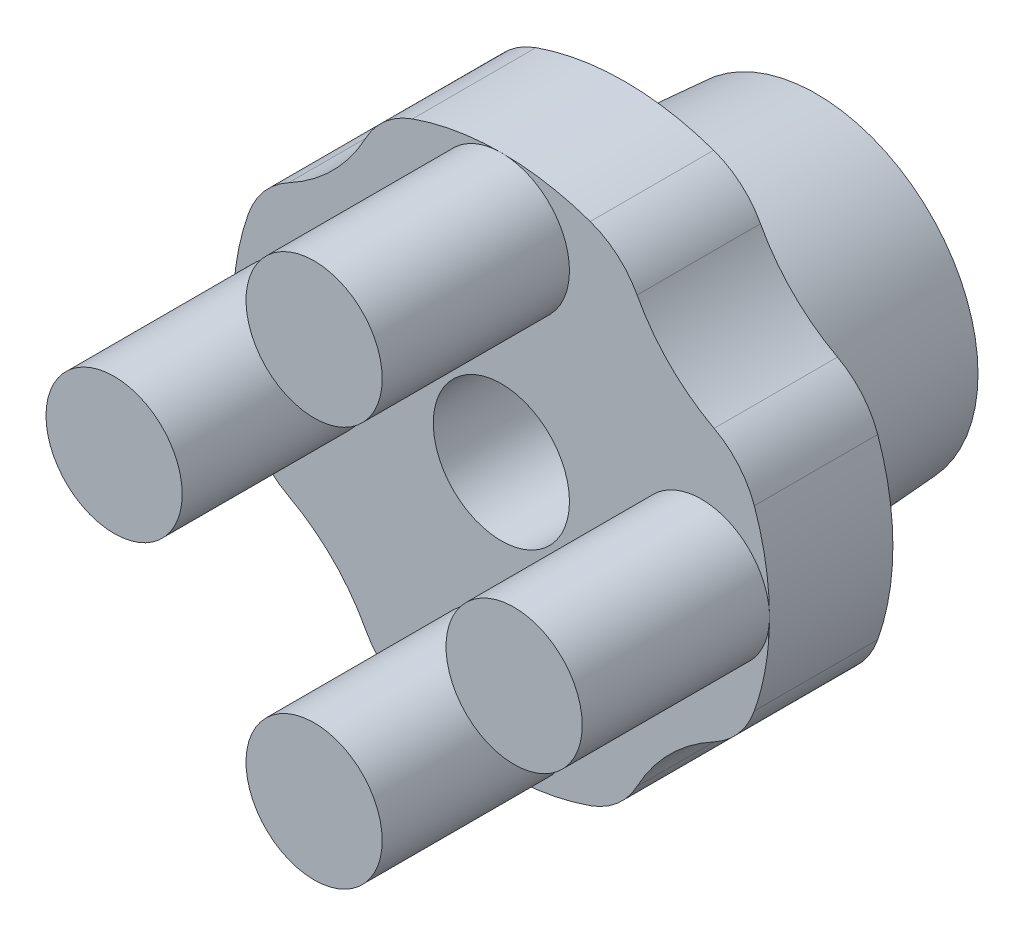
ISO-10303-21;
HEADER;
FILE_DESCRIPTION(('STEP AP214'),'2;1');
FILE_NAME('part.step','',(''),(''),'','','');
FILE_SCHEMA(('AUTOMOTIVE_DESIGN { 1 0 10303 214 1 1 1 1 }'));
ENDSEC;
DATA;
#1=APPLICATION_CONTEXT('core data for automotive mechanical design processes');
#2=APPLICATION_PROTOCOL_DEFINITION('international standard','automotive_design',2000,#1);
#3=PRODUCT_CONTEXT('',#1,'mechanical');
#4=PRODUCT('Part','Part','',(#3));
#5=PRODUCT_RELATED_PRODUCT_CATEGORY('part','',(#4));
#6=PRODUCT_DEFINITION_FORMATION('','',#4);
#7=PRODUCT_DEFINITION_CONTEXT('part definition',#1,'design');
#8=PRODUCT_DEFINITION('design','',#6,#7);
#9=PRODUCT_DEFINITION_SHAPE('','',#8);
#10=(LENGTH_UNIT() NAMED_UNIT(*) SI_UNIT(.MILLI.,.METRE.));
#11=(NAMED_UNIT(*) PLANE_ANGLE_UNIT() SI_UNIT($,.RADIAN.));
#12=(NAMED_UNIT(*) SI_UNIT($,.STERADIAN.) SOLID_ANGLE_UNIT());
#13=UNCERTAINTY_MEASURE_WITH_UNIT(LENGTH_MEASURE(1.E-05),#10,'distance_accuracy_value','');
#14=(GEOMETRIC_REPRESENTATION_CONTEXT(3) GLOBAL_UNCERTAINTY_ASSIGNED_CONTEXT((#13)) GLOBAL_UNIT_ASSIGNED_CONTEXT((#10,
#11,#12)) REPRESENTATION_CONTEXT('',''));
#15=CARTESIAN_POINT('',(0.,0.,0.));
#16=DIRECTION('',(0.,0.,1.));
#17=DIRECTION('',(1.,0.,0.));
#18=AXIS2_PLACEMENT_3D('',#15,#16,#17);
#19=CARTESIAN_POINT('',(0.,0.,90.));
#20=DIRECTION('',(0.,0.,1.));
#21=DIRECTION('',(1.,0.,0.));
#22=AXIS2_PLACEMENT_3D('',#19,#20,#21);
#23=CYLINDRICAL_SURFACE('',#22,31.5);
#24=CARTESIAN_POINT('',(0.,0.,22.5));
#25=DIRECTION('',(0.,0.,1.));
#26=DIRECTION('',(1.,0.,0.));
#27=AXIS2_PLACEMENT_3D('',#24,#25,#26);
#28=CIRCLE('',#27,31.5);
#29=CARTESIAN_POINT('',(-29.7192701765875,10.44102390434,22.5));
#30=VERTEX_POINT('',#29);
#31=CARTESIAN_POINT('',(-29.7192701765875,-10.44102390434,22.5));
#32=VERTEX_POINT('',#31);
#33=EDGE_CURVE('E171',#30,#32,#28,.T.);
#34=ORIENTED_EDGE('',*,*,#33,.T.);
#35=DIRECTION('',(0.,0.,1.));
#36=VECTOR('',#35,1.);
#37=CARTESIAN_POINT('',(-29.7192701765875,-10.44102390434,90.));
#38=LINE('',#37,#36);
#39=CARTESIAN_POINT('',(-29.7192701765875,-10.44102390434,37.));
#40=VERTEX_POINT('',#39);
#41=EDGE_CURVE('E225',#32,#40,#38,.T.);
#42=ORIENTED_EDGE('',*,*,#41,.T.);
#43=CARTESIAN_POINT('',(0.,0.,37.));
#44=DIRECTION('',(0.,0.,1.));
#45=DIRECTION('',(1.,0.,0.));
#46=AXIS2_PLACEMENT_3D('',#43,#44,#45);
#47=CIRCLE('',#46,31.5);
#48=CARTESIAN_POINT('',(-31.5,0.,37.));
#49=VERTEX_POINT('',#48);
#50=EDGE_CURVE('E161',#49,#40,#47,.T.);
#51=ORIENTED_EDGE('',*,*,#50,.F.);
#52=CARTESIAN_POINT('',(-29.7192701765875,10.44102390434,37.));
#53=VERTEX_POINT('',#52);
#54=EDGE_CURVE('E157',#53,#49,#47,.T.);
#55=ORIENTED_EDGE('',*,*,#54,.F.);
#56=DIRECTION('',(0.,0.,1.));
#57=VECTOR('',#56,1.);
#58=CARTESIAN_POINT('',(-29.7192701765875,10.44102390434,90.));
#59=LINE('',#58,#57);
#60=EDGE_CURVE('E223',#53,#30,#59,.F.);
#61=ORIENTED_EDGE('',*,*,#60,.T.);
#62=EDGE_LOOP('',(#34,#42,#51,#55,#61));
#63=FACE_BOUND('',#62,.T.);
#64=ADVANCED_FACE('F14',(#63),#23,.T.);
#65=CARTESIAN_POINT('',(-31.5,0.,37.));
#66=DIRECTION('',(0.,0.,-1.));
#67=DIRECTION('',(-1.,0.,0.));
#68=AXIS2_PLACEMENT_3D('',#65,#66,#67);
#69=PLANE('',#68);
#70=CARTESIAN_POINT('',(0.,0.,37.));
#71=DIRECTION('',(0.,0.,1.));
#72=DIRECTION('',(1.,0.,0.));
#73=AXIS2_PLACEMENT_3D('',#70,#71,#72);
#74=CIRCLE('',#73,8.);
#75=CARTESIAN_POINT('',(8.,0.,37.));
#76=VERTEX_POINT('',#75);
#77=EDGE_CURVE('E319',#76,#76,#74,.T.);
#78=ORIENTED_EDGE('',*,*,#77,.F.);
#79=EDGE_LOOP('',(#78));
#80=FACE_BOUND('',#79,.T.);
#81=CARTESIAN_POINT('',(0.,-31.5,37.));
#82=VERTEX_POINT('',#81);
#83=CARTESIAN_POINT('',(10.44102390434,-29.7192701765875,37.));
#84=VERTEX_POINT('',#83);
#85=EDGE_CURVE('E147',#82,#84,#47,.T.);
#86=ORIENTED_EDGE('',*,*,#85,.T.);
#87=CARTESIAN_POINT('',(7.12641314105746,-20.2845812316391,37.));
#88=DIRECTION('',(0.,0.,-1.));
#89=DIRECTION('',(-1.,0.,0.));
#90=AXIS2_PLACEMENT_3D('',#87,#88,#89);
#91=CIRCLE('',#90,10.);
#92=CARTESIAN_POINT('',(15.9479524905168,-24.9941930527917,37.));
#93=VERTEX_POINT('',#92);
#94=EDGE_CURVE('E246',#84,#93,#91,.F.);
#95=ORIENTED_EDGE('',*,*,#94,.T.);
#96=CARTESIAN_POINT('',(35.3553390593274,-35.3553390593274,37.));
#97=DIRECTION('',(0.,0.,1.));
#98=DIRECTION('',(1.,0.,0.));
#99=AXIS2_PLACEMENT_3D('',#96,#97,#98);
#100=CIRCLE('',#99,22.);
#101=CARTESIAN_POINT('',(24.9941930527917,-15.9479524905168,37.));
#102=VERTEX_POINT('',#101);
#103=EDGE_CURVE('E285',#102,#93,#100,.T.);
#104=ORIENTED_EDGE('',*,*,#103,.F.);
#105=CARTESIAN_POINT('',(20.2845812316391,-7.12641314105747,37.));
#106=DIRECTION('',(0.,0.,-1.));
#107=DIRECTION('',(-1.,0.,0.));
#108=AXIS2_PLACEMENT_3D('',#105,#106,#107);
#109=CIRCLE('',#108,10.);
#110=CARTESIAN_POINT('',(29.7192701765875,-10.44102390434,37.));
#111=VERTEX_POINT('',#110);
#112=EDGE_CURVE('E146',#102,#111,#109,.F.);
#113=ORIENTED_EDGE('',*,*,#112,.T.);
#114=CARTESIAN_POINT('',(31.5,0.,37.));
#115=VERTEX_POINT('',#114);
#116=EDGE_CURVE('E139',#111,#115,#47,.T.);
#117=ORIENTED_EDGE('',*,*,#116,.T.);
#118=CARTESIAN_POINT('',(23.5,0.,37.));
#119=DIRECTION('',(0.,0.,1.));
#120=DIRECTION('',(1.,0.,0.));
#121=AXIS2_PLACEMENT_3D('',#118,#119,#120);
#122=CIRCLE('',#121,8.);
#123=EDGE_CURVE('E144',#115,#115,#122,.T.);
#124=ORIENTED_EDGE('',*,*,#123,.F.);
#125=CARTESIAN_POINT('',(29.7192701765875,10.44102390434,37.));
#126=VERTEX_POINT('',#125);
#127=EDGE_CURVE('E148',#115,#126,#47,.T.);
#128=ORIENTED_EDGE('',*,*,#127,.T.);
#129=CARTESIAN_POINT('',(20.2845812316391,7.12641314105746,37.));
#130=DIRECTION('',(0.,0.,-1.));
#131=DIRECTION('',(-1.,0.,0.));
#132=AXIS2_PLACEMENT_3D('',#129,#130,#131);
#133=CIRCLE('',#132,10.);
#134=CARTESIAN_POINT('',(24.9941930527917,15.9479524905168,37.));
#135=VERTEX_POINT('',#134);
#136=EDGE_CURVE('E207',#126,#135,#133,.F.);
#137=ORIENTED_EDGE('',*,*,#136,.T.);
#138=CARTESIAN_POINT('',(35.3553390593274,35.3553390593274,37.));
#139=DIRECTION('',(0.,0.,-1.));
#140=DIRECTION('',(-1.,0.,0.));
#141=AXIS2_PLACEMENT_3D('',#138,#139,#140);
#142=CIRCLE('',#141,22.);
#143=CARTESIAN_POINT('',(15.9479524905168,24.9941930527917,37.));
#144=VERTEX_POINT('',#143);
#145=EDGE_CURVE('E290',#135,#144,#142,.T.);
#146=ORIENTED_EDGE('',*,*,#145,.T.);
#147=CARTESIAN_POINT('',(7.12641314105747,20.2845812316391,37.));
#148=DIRECTION('',(0.,0.,-1.));
#149=DIRECTION('',(-1.,0.,0.));
#150=AXIS2_PLACEMENT_3D('',#147,#148,#149);
#151=CIRCLE('',#150,10.);
#152=CARTESIAN_POINT('',(10.44102390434,29.7192701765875,37.));
#153=VERTEX_POINT('',#152);
#154=EDGE_CURVE('E203',#144,#153,#151,.F.);
#155=ORIENTED_EDGE('',*,*,#154,.T.);
#156=CARTESIAN_POINT('',(0.,31.5,37.));
#157=VERTEX_POINT('',#156);
#158=EDGE_CURVE('E155',#153,#157,#47,.T.);
#159=ORIENTED_EDGE('',*,*,#158,.T.);
#160=CARTESIAN_POINT('',(0.,23.5,37.));
#161=DIRECTION('',(0.,0.,1.));
#162=DIRECTION('',(1.,0.,0.));
#163=AXIS2_PLACEMENT_3D('',#160,#161,#162);
#164=CIRCLE('',#163,8.);
#165=EDGE_CURVE('E277',#157,#157,#164,.T.);
#166=ORIENTED_EDGE('',*,*,#165,.F.);
#167=CARTESIAN_POINT('',(-10.44102390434,29.7192701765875,37.));
#168=VERTEX_POINT('',#167);
#169=EDGE_CURVE('E156',#157,#168,#47,.T.);
#170=ORIENTED_EDGE('',*,*,#169,.T.);
#171=CARTESIAN_POINT('',(-7.12641314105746,20.2845812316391,37.));
#172=DIRECTION('',(0.,0.,-1.));
#173=DIRECTION('',(-1.,0.,0.));
#174=AXIS2_PLACEMENT_3D('',#171,#172,#173);
#175=CIRCLE('',#174,10.);
#176=CARTESIAN_POINT('',(-15.9479524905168,24.9941930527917,37.));
#177=VERTEX_POINT('',#176);
#178=EDGE_CURVE('E202',#168,#177,#175,.F.);
#179=ORIENTED_EDGE('',*,*,#178,.T.);
#180=CARTESIAN_POINT('',(-35.3553390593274,35.3553390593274,37.));
#181=DIRECTION('',(0.,0.,1.));
#182=DIRECTION('',(1.,0.,0.));
#183=AXIS2_PLACEMENT_3D('',#180,#181,#182);
#184=CIRCLE('',#183,22.);
#185=CARTESIAN_POINT('',(-24.9941930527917,15.9479524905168,37.));
#186=VERTEX_POINT('',#185);
#187=EDGE_CURVE('E302',#186,#177,#184,.T.);
#188=ORIENTED_EDGE('',*,*,#187,.F.);
#189=CARTESIAN_POINT('',(-20.2845812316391,7.12641314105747,37.));
#190=DIRECTION('',(0.,0.,-1.));
#191=DIRECTION('',(-1.,0.,0.));
#192=AXIS2_PLACEMENT_3D('',#189,#190,#191);
#193=CIRCLE('',#192,10.);
#194=EDGE_CURVE('E309',#186,#53,#193,.F.);
#195=ORIENTED_EDGE('',*,*,#194,.T.);
#196=ORIENTED_EDGE('',*,*,#54,.T.);
#197=CARTESIAN_POINT('',(-23.5,0.,37.));
#198=DIRECTION('',(0.,0.,1.));
#199=DIRECTION('',(1.,0.,0.));
#200=AXIS2_PLACEMENT_3D('',#197,#198,#199);
#201=CIRCLE('',#200,8.);
#202=EDGE_CURVE('E269',#49,#49,#201,.T.);
#203=ORIENTED_EDGE('',*,*,#202,.F.);
#204=ORIENTED_EDGE('',*,*,#50,.T.);
#205=CARTESIAN_POINT('',(-20.2845812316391,-7.12641314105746,37.));
#206=DIRECTION('',(0.,0.,-1.));
#207=DIRECTION('',(-1.,0.,0.));
#208=AXIS2_PLACEMENT_3D('',#205,#206,#207);
#209=CIRCLE('',#208,10.);
#210=CARTESIAN_POINT('',(-24.9941930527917,-15.9479524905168,37.));
#211=VERTEX_POINT('',#210);
#212=EDGE_CURVE('E230',#40,#211,#209,.F.);
#213=ORIENTED_EDGE('',*,*,#212,.T.);
#214=CARTESIAN_POINT('',(-35.3553390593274,-35.3553390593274,37.));
#215=DIRECTION('',(0.,0.,-1.));
#216=DIRECTION('',(-1.,0.,0.));
#217=AXIS2_PLACEMENT_3D('',#214,#215,#216);
#218=CIRCLE('',#217,22.);
#219=CARTESIAN_POINT('',(-15.9479524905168,-24.9941930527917,37.));
#220=VERTEX_POINT('',#219);
#221=EDGE_CURVE('E296',#211,#220,#218,.T.);
#222=ORIENTED_EDGE('',*,*,#221,.T.);
#223=CARTESIAN_POINT('',(-7.12641314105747,-20.2845812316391,37.));
#224=DIRECTION('',(0.,0.,-1.));
#225=DIRECTION('',(-1.,0.,0.));
#226=AXIS2_PLACEMENT_3D('',#223,#224,#225);
#227=CIRCLE('',#226,10.);
#228=CARTESIAN_POINT('',(-10.44102390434,-29.7192701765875,37.));
#229=VERTEX_POINT('',#228);
#230=EDGE_CURVE('E228',#220,#229,#227,.F.);
#231=ORIENTED_EDGE('',*,*,#230,.T.);
#232=EDGE_CURVE('E150',#229,#82,#47,.T.);
#233=ORIENTED_EDGE('',*,*,#232,.T.);
#234=CARTESIAN_POINT('',(0.,-23.5,37.));
#235=DIRECTION('',(0.,0.,1.));
#236=DIRECTION('',(1.,0.,0.));
#237=AXIS2_PLACEMENT_3D('',#234,#235,#236);
#238=CIRCLE('',#237,8.);
#239=EDGE_CURVE('E263',#82,#82,#238,.T.);
#240=ORIENTED_EDGE('',*,*,#239,.F.);
#241=EDGE_LOOP('',(#86,#95,#104,#113,#117,#124,#128,#137,#146,#155,#159,#166,#170,#179,#188,
#195,#196,#203,#204,#213,#222,#231,#233,#240));
#242=FACE_BOUND('',#241,.T.);
#243=ADVANCED_FACE('F16',(#80,#242),#69,.F.);
#244=CARTESIAN_POINT('',(-20.5,0.,22.5));
#245=DIRECTION('',(0.,0.,1.));
#246=DIRECTION('',(1.,0.,0.));
#247=AXIS2_PLACEMENT_3D('',#244,#245,#246);
#248=PLANE('',#247);
#249=CARTESIAN_POINT('',(0.,0.,22.5));
#250=DIRECTION('',(0.,0.,1.));
#251=DIRECTION('',(1.,0.,0.));
#252=AXIS2_PLACEMENT_3D('',#249,#250,#251);
#253=CIRCLE('',#252,20.5);
#254=CARTESIAN_POINT('',(20.5,0.,22.5));
#255=VERTEX_POINT('',#254);
#256=EDGE_CURVE('E180',#255,#255,#253,.T.);
#257=ORIENTED_EDGE('',*,*,#256,.T.);
#258=EDGE_LOOP('',(#257));
#259=FACE_BOUND('',#258,.T.);
#260=CARTESIAN_POINT('',(35.3553390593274,-35.3553390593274,22.5));
#261=DIRECTION('',(0.,0.,1.));
#262=DIRECTION('',(1.,0.,0.));
#263=AXIS2_PLACEMENT_3D('',#260,#261,#262);
#264=CIRCLE('',#263,22.);
#265=CARTESIAN_POINT('',(24.9941930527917,-15.9479524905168,22.5));
#266=VERTEX_POINT('',#265);
#267=CARTESIAN_POINT('',(15.9479524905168,-24.9941930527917,22.5));
#268=VERTEX_POINT('',#267);
#269=EDGE_CURVE('E256',#266,#268,#264,.T.);
#270=ORIENTED_EDGE('',*,*,#269,.T.);
#271=CARTESIAN_POINT('',(7.12641314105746,-20.2845812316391,22.5));
#272=DIRECTION('',(0.,0.,1.));
#273=DIRECTION('',(1.,0.,0.));
#274=AXIS2_PLACEMENT_3D('',#271,#272,#273);
#275=CIRCLE('',#274,10.);
#276=CARTESIAN_POINT('',(10.44102390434,-29.7192701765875,22.5));
#277=VERTEX_POINT('',#276);
#278=EDGE_CURVE('E22',#268,#277,#275,.F.);
#279=ORIENTED_EDGE('',*,*,#278,.T.);
#280=CARTESIAN_POINT('',(-10.44102390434,-29.7192701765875,22.5));
#281=VERTEX_POINT('',#280);
#282=EDGE_CURVE('E167',#281,#277,#28,.T.);
#283=ORIENTED_EDGE('',*,*,#282,.F.);
#284=CARTESIAN_POINT('',(-7.12641314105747,-20.2845812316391,22.5));
#285=DIRECTION('',(0.,0.,1.));
#286=DIRECTION('',(1.,0.,0.));
#287=AXIS2_PLACEMENT_3D('',#284,#285,#286);
#288=CIRCLE('',#287,10.);
#289=CARTESIAN_POINT('',(-15.9479524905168,-24.9941930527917,22.5));
#290=VERTEX_POINT('',#289);
#291=EDGE_CURVE('E237',#281,#290,#288,.F.);
#292=ORIENTED_EDGE('',*,*,#291,.T.);
#293=CARTESIAN_POINT('',(-35.3553390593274,-35.3553390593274,22.5));
#294=DIRECTION('',(0.,0.,1.));
#295=DIRECTION('',(1.,0.,0.));
#296=AXIS2_PLACEMENT_3D('',#293,#294,#295);
#297=CIRCLE('',#296,22.);
#298=CARTESIAN_POINT('',(-24.9941930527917,-15.9479524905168,22.5));
#299=VERTEX_POINT('',#298);
#300=EDGE_CURVE('E293',#299,#290,#297,.F.);
#301=ORIENTED_EDGE('',*,*,#300,.F.);
#302=CARTESIAN_POINT('',(-20.2845812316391,-7.12641314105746,22.5));
#303=DIRECTION('',(0.,0.,1.));
#304=DIRECTION('',(1.,0.,0.));
#305=AXIS2_PLACEMENT_3D('',#302,#303,#304);
#306=CIRCLE('',#305,10.);
#307=EDGE_CURVE('E239',#299,#32,#306,.F.);
#308=ORIENTED_EDGE('',*,*,#307,.T.);
#309=ORIENTED_EDGE('',*,*,#33,.F.);
#310=CARTESIAN_POINT('',(-20.2845812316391,7.12641314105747,22.5));
#311=DIRECTION('',(0.,0.,1.));
#312=DIRECTION('',(1.,0.,0.));
#313=AXIS2_PLACEMENT_3D('',#310,#311,#312);
#314=CIRCLE('',#313,10.);
#315=CARTESIAN_POINT('',(-24.9941930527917,15.9479524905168,22.5));
#316=VERTEX_POINT('',#315);
#317=EDGE_CURVE('E205',#30,#316,#314,.F.);
#318=ORIENTED_EDGE('',*,*,#317,.T.);
#319=CARTESIAN_POINT('',(-35.3553390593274,35.3553390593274,22.5));
#320=DIRECTION('',(0.,0.,1.));
#321=DIRECTION('',(1.,0.,0.));
#322=AXIS2_PLACEMENT_3D('',#319,#320,#321);
#323=CIRCLE('',#322,22.);
#324=CARTESIAN_POINT('',(-15.9479524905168,24.9941930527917,22.5));
#325=VERTEX_POINT('',#324);
#326=EDGE_CURVE('E299',#316,#325,#323,.T.);
#327=ORIENTED_EDGE('',*,*,#326,.T.);
#328=CARTESIAN_POINT('',(-7.12641314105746,20.2845812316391,22.5));
#329=DIRECTION('',(0.,0.,1.));
#330=DIRECTION('',(1.,0.,0.));
#331=AXIS2_PLACEMENT_3D('',#328,#329,#330);
#332=CIRCLE('',#331,10.);
#333=CARTESIAN_POINT('',(-10.44102390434,29.7192701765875,22.5));
#334=VERTEX_POINT('',#333);
#335=EDGE_CURVE('E201',#325,#334,#332,.F.);
#336=ORIENTED_EDGE('',*,*,#335,.T.);
#337=CARTESIAN_POINT('',(10.44102390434,29.7192701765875,22.5));
#338=VERTEX_POINT('',#337);
#339=EDGE_CURVE('E178',#338,#334,#28,.T.);
#340=ORIENTED_EDGE('',*,*,#339,.F.);
#341=CARTESIAN_POINT('',(7.12641314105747,20.2845812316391,22.5));
#342=DIRECTION('',(0.,0.,1.));
#343=DIRECTION('',(1.,0.,0.));
#344=AXIS2_PLACEMENT_3D('',#341,#342,#343);
#345=CIRCLE('',#344,10.);
#346=CARTESIAN_POINT('',(15.9479524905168,24.9941930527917,22.5));
#347=VERTEX_POINT('',#346);
#348=EDGE_CURVE('E215',#338,#347,#345,.F.);
#349=ORIENTED_EDGE('',*,*,#348,.T.);
#350=CARTESIAN_POINT('',(35.3553390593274,35.3553390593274,22.5));
#351=DIRECTION('',(0.,0.,1.));
#352=DIRECTION('',(1.,0.,0.));
#353=AXIS2_PLACEMENT_3D('',#350,#351,#352);
#354=CIRCLE('',#353,22.);
#355=CARTESIAN_POINT('',(24.9941930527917,15.9479524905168,22.5));
#356=VERTEX_POINT('',#355);
#357=EDGE_CURVE('E287',#356,#347,#354,.F.);
#358=ORIENTED_EDGE('',*,*,#357,.F.);
#359=CARTESIAN_POINT('',(20.2845812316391,7.12641314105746,22.5));
#360=DIRECTION('',(0.,0.,1.));
#361=DIRECTION('',(1.,0.,0.));
#362=AXIS2_PLACEMENT_3D('',#359,#360,#361);
#363=CIRCLE('',#362,10.);
#364=CARTESIAN_POINT('',(29.7192701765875,10.44102390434,22.5));
#365=VERTEX_POINT('',#364);
#366=EDGE_CURVE('E213',#356,#365,#363,.F.);
#367=ORIENTED_EDGE('',*,*,#366,.T.);
#368=CARTESIAN_POINT('',(29.7192701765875,-10.44102390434,22.5));
#369=VERTEX_POINT('',#368);
#370=EDGE_CURVE('E172',#369,#365,#28,.T.);
#371=ORIENTED_EDGE('',*,*,#370,.F.);
#372=CARTESIAN_POINT('',(20.2845812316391,-7.12641314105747,22.5));
#373=DIRECTION('',(0.,0.,1.));
#374=DIRECTION('',(1.,0.,0.));
#375=AXIS2_PLACEMENT_3D('',#372,#373,#374);
#376=CIRCLE('',#375,10.);
#377=EDGE_CURVE('E252',#369,#266,#376,.F.);
#378=ORIENTED_EDGE('',*,*,#377,.T.);
#379=EDGE_LOOP('',(#270,#279,#283,#292,#301,#308,#309,#318,#327,#336,#340,#349,#358,#367,#371,#378));
#380=FACE_BOUND('',#379,.T.);
#381=ADVANCED_FACE('F254',(#259,#380),#248,.F.);
#382=ORIENTED_EDGE('',*,*,#282,.T.);
#383=DIRECTION('',(0.,0.,1.));
#384=VECTOR('',#383,1.);
#385=CARTESIAN_POINT('',(10.44102390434,-29.7192701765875,90.));
#386=LINE('',#385,#384);
#387=EDGE_CURVE('E243',#277,#84,#386,.T.);
#388=ORIENTED_EDGE('',*,*,#387,.T.);
#389=ORIENTED_EDGE('',*,*,#85,.F.);
#390=ORIENTED_EDGE('',*,*,#232,.F.);
#391=DIRECTION('',(0.,0.,1.));
#392=VECTOR('',#391,1.);
#393=CARTESIAN_POINT('',(-10.44102390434,-29.7192701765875,90.));
#394=LINE('',#393,#392);
#395=EDGE_CURVE('E241',#229,#281,#394,.F.);
#396=ORIENTED_EDGE('',*,*,#395,.T.);
#397=EDGE_LOOP('',(#382,#388,#389,#390,#396));
#398=FACE_BOUND('',#397,.T.);
#399=ADVANCED_FACE('F259',(#398),#23,.T.);
#400=ORIENTED_EDGE('',*,*,#158,.F.);
#401=DIRECTION('',(0.,0.,1.));
#402=VECTOR('',#401,1.);
#403=CARTESIAN_POINT('',(10.44102390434,29.7192701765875,90.));
#404=LINE('',#403,#402);
#405=EDGE_CURVE('E194',#153,#338,#404,.F.);
#406=ORIENTED_EDGE('',*,*,#405,.T.);
#407=ORIENTED_EDGE('',*,*,#339,.T.);
#408=DIRECTION('',(0.,0.,1.));
#409=VECTOR('',#408,1.);
#410=CARTESIAN_POINT('',(-10.44102390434,29.7192701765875,90.));
#411=LINE('',#410,#409);
#412=EDGE_CURVE('E192',#334,#168,#411,.T.);
#413=ORIENTED_EDGE('',*,*,#412,.T.);
#414=ORIENTED_EDGE('',*,*,#169,.F.);
#415=EDGE_LOOP('',(#400,#406,#407,#413,#414));
#416=FACE_BOUND('',#415,.T.);
#417=ADVANCED_FACE('F190',(#416),#23,.T.);
#418=ORIENTED_EDGE('',*,*,#116,.F.);
#419=DIRECTION('',(0.,0.,1.));
#420=VECTOR('',#419,1.);
#421=CARTESIAN_POINT('',(29.7192701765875,-10.44102390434,90.));
#422=LINE('',#421,#420);
#423=EDGE_CURVE('E9',#111,#369,#422,.F.);
#424=ORIENTED_EDGE('',*,*,#423,.T.);
#425=ORIENTED_EDGE('',*,*,#370,.T.);
#426=DIRECTION('',(0.,0.,1.));
#427=VECTOR('',#426,1.);
#428=CARTESIAN_POINT('',(29.7192701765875,10.44102390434,90.));
#429=LINE('',#428,#427);
#430=EDGE_CURVE('E154',#365,#126,#429,.T.);
#431=ORIENTED_EDGE('',*,*,#430,.T.);
#432=ORIENTED_EDGE('',*,*,#127,.F.);
#433=EDGE_LOOP('',(#418,#424,#425,#431,#432));
#434=FACE_BOUND('',#433,.T.);
#435=ADVANCED_FACE('F152',(#434),#23,.T.);
#436=CARTESIAN_POINT('',(0.,0.,90.));
#437=DIRECTION('',(0.,0.,1.));
#438=DIRECTION('',(1.,0.,0.));
#439=AXIS2_PLACEMENT_3D('',#436,#437,#438);
#440=CYLINDRICAL_SURFACE('',#439,8.);
#441=CARTESIAN_POINT('',(0.,0.,0.));
#442=DIRECTION('',(0.,0.,1.));
#443=DIRECTION('',(1.,0.,0.));
#444=AXIS2_PLACEMENT_3D('',#441,#442,#443);
#445=CIRCLE('',#444,8.);
#446=CARTESIAN_POINT('',(8.,0.,0.));
#447=VERTEX_POINT('',#446);
#448=EDGE_CURVE('E322',#447,#447,#445,.T.);
#449=ORIENTED_EDGE('',*,*,#448,.F.);
#450=EDGE_LOOP('',(#449));
#451=FACE_BOUND('',#450,.T.);
#452=ORIENTED_EDGE('',*,*,#77,.T.);
#453=EDGE_LOOP('',(#452));
#454=FACE_BOUND('',#453,.T.);
#455=ADVANCED_FACE('F334',(#451,#454),#440,.F.);
#456=CARTESIAN_POINT('',(-8.,0.,0.));
#457=DIRECTION('',(0.,0.,1.));
#458=DIRECTION('',(1.,0.,0.));
#459=AXIS2_PLACEMENT_3D('',#456,#457,#458);
#460=PLANE('',#459);
#461=CARTESIAN_POINT('',(0.,0.,0.));
#462=DIRECTION('',(0.,0.,1.));
#463=DIRECTION('',(1.,0.,0.));
#464=AXIS2_PLACEMENT_3D('',#461,#462,#463);
#465=CIRCLE('',#464,19.);
#466=CARTESIAN_POINT('',(19.,0.,0.));
#467=VERTEX_POINT('',#466);
#468=EDGE_CURVE('E183',#467,#467,#465,.T.);
#469=ORIENTED_EDGE('',*,*,#468,.F.);
#470=EDGE_LOOP('',(#469));
#471=FACE_BOUND('',#470,.T.);
#472=ORIENTED_EDGE('',*,*,#448,.T.);
#473=EDGE_LOOP('',(#472));
#474=FACE_BOUND('',#473,.T.);
#475=ADVANCED_FACE('F331',(#471,#474),#460,.F.);
#476=CARTESIAN_POINT('',(0.,0.,22.5));
#477=DIRECTION('',(0.,0.,1.));
#478=DIRECTION('',(1.,0.,0.));
#479=AXIS2_PLACEMENT_3D('',#476,#477,#478);
#480=CONICAL_SURFACE('',#479,20.5,0.0665681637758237);
#481=ORIENTED_EDGE('',*,*,#468,.T.);
#482=EDGE_LOOP('',(#481));
#483=FACE_BOUND('',#482,.T.);
#484=ORIENTED_EDGE('',*,*,#256,.F.);
#485=EDGE_LOOP('',(#484));
#486=FACE_BOUND('',#485,.T.);
#487=ADVANCED_FACE('F328',(#483,#486),#480,.T.);
#488=CARTESIAN_POINT('',(0.,-23.5,59.));
#489=DIRECTION('',(0.,0.,-1.));
#490=DIRECTION('',(-1.,0.,0.));
#491=AXIS2_PLACEMENT_3D('',#488,#489,#490);
#492=CYLINDRICAL_SURFACE('',#491,8.);
#493=CARTESIAN_POINT('',(0.,-23.5,59.));
#494=DIRECTION('',(0.,0.,1.));
#495=DIRECTION('',(1.,0.,0.));
#496=AXIS2_PLACEMENT_3D('',#493,#494,#495);
#497=CIRCLE('',#496,8.);
#498=CARTESIAN_POINT('',(8.,-23.5,59.));
#499=VERTEX_POINT('',#498);
#500=EDGE_CURVE('E166',#499,#499,#497,.T.);
#501=ORIENTED_EDGE('',*,*,#500,.F.);
#502=EDGE_LOOP('',(#501));
#503=FACE_BOUND('',#502,.T.);
#504=ORIENTED_EDGE('',*,*,#239,.T.);
#505=EDGE_LOOP('',(#504));
#506=FACE_BOUND('',#505,.T.);
#507=ADVANCED_FACE('F383',(#503,#506),#492,.T.);
#508=CARTESIAN_POINT('',(0.,-23.5,59.));
#509=DIRECTION('',(0.,0.,1.));
#510=DIRECTION('',(1.,0.,0.));
#511=AXIS2_PLACEMENT_3D('',#508,#509,#510);
#512=PLANE('',#511);
#513=ORIENTED_EDGE('',*,*,#500,.T.);
#514=EDGE_LOOP('',(#513));
#515=FACE_BOUND('',#514,.T.);
#516=ADVANCED_FACE('F385',(#515),#512,.T.);
#517=CARTESIAN_POINT('',(-23.5,0.,59.));
#518=DIRECTION('',(0.,0.,-1.));
#519=DIRECTION('',(-1.,0.,0.));
#520=AXIS2_PLACEMENT_3D('',#517,#518,#519);
#521=CYLINDRICAL_SURFACE('',#520,8.);
#522=CARTESIAN_POINT('',(-23.5,0.,59.));
#523=DIRECTION('',(0.,0.,1.));
#524=DIRECTION('',(1.,0.,0.));
#525=AXIS2_PLACEMENT_3D('',#522,#523,#524);
#526=CIRCLE('',#525,8.);
#527=CARTESIAN_POINT('',(-15.5,0.,59.));
#528=VERTEX_POINT('',#527);
#529=EDGE_CURVE('E265',#528,#528,#526,.T.);
#530=ORIENTED_EDGE('',*,*,#529,.F.);
#531=EDGE_LOOP('',(#530));
#532=FACE_BOUND('',#531,.T.);
#533=ORIENTED_EDGE('',*,*,#202,.T.);
#534=EDGE_LOOP('',(#533));
#535=FACE_BOUND('',#534,.T.);
#536=ADVANCED_FACE('F400',(#532,#535),#521,.T.);
#537=CARTESIAN_POINT('',(-23.5,0.,59.));
#538=DIRECTION('',(0.,0.,1.));
#539=DIRECTION('',(1.,0.,0.));
#540=AXIS2_PLACEMENT_3D('',#537,#538,#539);
#541=PLANE('',#540);
#542=ORIENTED_EDGE('',*,*,#529,.T.);
#543=EDGE_LOOP('',(#542));
#544=FACE_BOUND('',#543,.T.);
#545=ADVANCED_FACE('F393',(#544),#541,.T.);
#546=CARTESIAN_POINT('',(0.,23.5,59.));
#547=DIRECTION('',(0.,0.,-1.));
#548=DIRECTION('',(-1.,0.,0.));
#549=AXIS2_PLACEMENT_3D('',#546,#547,#548);
#550=CYLINDRICAL_SURFACE('',#549,8.);
#551=CARTESIAN_POINT('',(0.,23.5,59.));
#552=DIRECTION('',(0.,0.,1.));
#553=DIRECTION('',(1.,0.,0.));
#554=AXIS2_PLACEMENT_3D('',#551,#552,#553);
#555=CIRCLE('',#554,8.);
#556=CARTESIAN_POINT('',(8.,23.5,59.));
#557=VERTEX_POINT('',#556);
#558=EDGE_CURVE('E274',#557,#557,#555,.T.);
#559=ORIENTED_EDGE('',*,*,#558,.F.);
#560=EDGE_LOOP('',(#559));
#561=FACE_BOUND('',#560,.T.);
#562=ORIENTED_EDGE('',*,*,#165,.T.);
#563=EDGE_LOOP('',(#562));
#564=FACE_BOUND('',#563,.T.);
#565=ADVANCED_FACE('F418',(#561,#564),#550,.T.);
#566=CARTESIAN_POINT('',(0.,23.5,59.));
#567=DIRECTION('',(0.,0.,1.));
#568=DIRECTION('',(1.,0.,0.));
#569=AXIS2_PLACEMENT_3D('',#566,#567,#568);
#570=PLANE('',#569);
#571=ORIENTED_EDGE('',*,*,#558,.T.);
#572=EDGE_LOOP('',(#571));
#573=FACE_BOUND('',#572,.T.);
#574=ADVANCED_FACE('F411',(#573),#570,.T.);
#575=CARTESIAN_POINT('',(23.5,0.,59.));
#576=DIRECTION('',(0.,0.,-1.));
#577=DIRECTION('',(-1.,0.,0.));
#578=AXIS2_PLACEMENT_3D('',#575,#576,#577);
#579=CYLINDRICAL_SURFACE('',#578,8.);
#580=CARTESIAN_POINT('',(23.5,0.,59.));
#581=DIRECTION('',(0.,0.,1.));
#582=DIRECTION('',(1.,0.,0.));
#583=AXIS2_PLACEMENT_3D('',#580,#581,#582);
#584=CIRCLE('',#583,8.);
#585=CARTESIAN_POINT('',(31.5,0.,59.));
#586=VERTEX_POINT('',#585);
#587=EDGE_CURVE('E280',#586,#586,#584,.T.);
#588=ORIENTED_EDGE('',*,*,#587,.F.);
#589=EDGE_LOOP('',(#588));
#590=FACE_BOUND('',#589,.T.);
#591=ORIENTED_EDGE('',*,*,#123,.T.);
#592=EDGE_LOOP('',(#591));
#593=FACE_BOUND('',#592,.T.);
#594=ADVANCED_FACE('F436',(#590,#593),#579,.T.);
#595=CARTESIAN_POINT('',(23.5,0.,59.));
#596=DIRECTION('',(0.,0.,1.));
#597=DIRECTION('',(1.,0.,0.));
#598=AXIS2_PLACEMENT_3D('',#595,#596,#597);
#599=PLANE('',#598);
#600=ORIENTED_EDGE('',*,*,#587,.T.);
#601=EDGE_LOOP('',(#600));
#602=FACE_BOUND('',#601,.T.);
#603=ADVANCED_FACE('F429',(#602),#599,.T.);
#604=CARTESIAN_POINT('',(35.3553390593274,-35.3553390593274,0.));
#605=DIRECTION('',(0.,0.,1.));
#606=DIRECTION('',(1.,0.,0.));
#607=AXIS2_PLACEMENT_3D('',#604,#605,#606);
#608=CYLINDRICAL_SURFACE('',#607,22.);
#609=ORIENTED_EDGE('',*,*,#103,.T.);
#610=DIRECTION('',(0.,0.,1.));
#611=VECTOR('',#610,1.);
#612=CARTESIAN_POINT('',(15.9479524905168,-24.9941930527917,0.));
#613=LINE('',#612,#611);
#614=EDGE_CURVE('E35',#93,#268,#613,.F.);
#615=ORIENTED_EDGE('',*,*,#614,.T.);
#616=ORIENTED_EDGE('',*,*,#269,.F.);
#617=DIRECTION('',(0.,0.,1.));
#618=VECTOR('',#617,1.);
#619=CARTESIAN_POINT('',(24.9941930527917,-15.9479524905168,0.));
#620=LINE('',#619,#618);
#621=EDGE_CURVE('E248',#266,#102,#620,.T.);
#622=ORIENTED_EDGE('',*,*,#621,.T.);
#623=EDGE_LOOP('',(#609,#615,#616,#622));
#624=FACE_BOUND('',#623,.T.);
#625=ADVANCED_FACE('F447',(#624),#608,.F.);
#626=CARTESIAN_POINT('',(35.3553390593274,35.3553390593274,0.));
#627=DIRECTION('',(0.,0.,1.));
#628=DIRECTION('',(1.,0.,0.));
#629=AXIS2_PLACEMENT_3D('',#626,#627,#628);
#630=CYLINDRICAL_SURFACE('',#629,22.);
#631=ORIENTED_EDGE('',*,*,#357,.T.);
#632=DIRECTION('',(0.,0.,1.));
#633=VECTOR('',#632,1.);
#634=CARTESIAN_POINT('',(15.9479524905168,24.9941930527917,0.));
#635=LINE('',#634,#633);
#636=EDGE_CURVE('E312',#347,#144,#635,.T.);
#637=ORIENTED_EDGE('',*,*,#636,.T.);
#638=ORIENTED_EDGE('',*,*,#145,.F.);
#639=DIRECTION('',(0.,0.,1.));
#640=VECTOR('',#639,1.);
#641=CARTESIAN_POINT('',(24.9941930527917,15.9479524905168,0.));
#642=LINE('',#641,#640);
#643=EDGE_CURVE('E317',#135,#356,#642,.F.);
#644=ORIENTED_EDGE('',*,*,#643,.T.);
#645=EDGE_LOOP('',(#631,#637,#638,#644));
#646=FACE_BOUND('',#645,.T.);
#647=ADVANCED_FACE('F462',(#646),#630,.F.);
#648=CARTESIAN_POINT('',(-35.3553390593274,-35.3553390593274,0.));
#649=DIRECTION('',(0.,0.,1.));
#650=DIRECTION('',(1.,0.,0.));
#651=AXIS2_PLACEMENT_3D('',#648,#649,#650);
#652=CYLINDRICAL_SURFACE('',#651,22.);
#653=ORIENTED_EDGE('',*,*,#221,.F.);
#654=DIRECTION('',(0.,0.,1.));
#655=VECTOR('',#654,1.);
#656=CARTESIAN_POINT('',(-24.9941930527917,-15.9479524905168,0.));
#657=LINE('',#656,#655);
#658=EDGE_CURVE('E235',#211,#299,#657,.F.);
#659=ORIENTED_EDGE('',*,*,#658,.T.);
#660=ORIENTED_EDGE('',*,*,#300,.T.);
#661=DIRECTION('',(0.,0.,1.));
#662=VECTOR('',#661,1.);
#663=CARTESIAN_POINT('',(-15.9479524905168,-24.9941930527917,0.));
#664=LINE('',#663,#662);
#665=EDGE_CURVE('E232',#290,#220,#664,.T.);
#666=ORIENTED_EDGE('',*,*,#665,.T.);
#667=EDGE_LOOP('',(#653,#659,#660,#666));
#668=FACE_BOUND('',#667,.T.);
#669=ADVANCED_FACE('F470',(#668),#652,.F.);
#670=CARTESIAN_POINT('',(-35.3553390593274,35.3553390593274,0.));
#671=DIRECTION('',(0.,0.,1.));
#672=DIRECTION('',(1.,0.,0.));
#673=AXIS2_PLACEMENT_3D('',#670,#671,#672);
#674=CYLINDRICAL_SURFACE('',#673,22.);
#675=ORIENTED_EDGE('',*,*,#187,.T.);
#676=DIRECTION('',(0.,0.,1.));
#677=VECTOR('',#676,1.);
#678=CARTESIAN_POINT('',(-15.9479524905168,24.9941930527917,0.));
#679=LINE('',#678,#677);
#680=EDGE_CURVE('E221',#177,#325,#679,.F.);
#681=ORIENTED_EDGE('',*,*,#680,.T.);
#682=ORIENTED_EDGE('',*,*,#326,.F.);
#683=DIRECTION('',(0.,0.,1.));
#684=VECTOR('',#683,1.);
#685=CARTESIAN_POINT('',(-24.9941930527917,15.9479524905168,0.));
#686=LINE('',#685,#684);
#687=EDGE_CURVE('E218',#316,#186,#686,.T.);
#688=ORIENTED_EDGE('',*,*,#687,.T.);
#689=EDGE_LOOP('',(#675,#681,#682,#688));
#690=FACE_BOUND('',#689,.T.);
#691=ADVANCED_FACE('F306',(#690),#674,.F.);
#692=CARTESIAN_POINT('',(7.12641314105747,20.2845812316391,90.));
#693=DIRECTION('',(0.,0.,-1.));
#694=DIRECTION('',(-1.,0.,0.));
#695=AXIS2_PLACEMENT_3D('',#692,#693,#694);
#696=CYLINDRICAL_SURFACE('',#695,10.);
#697=ORIENTED_EDGE('',*,*,#348,.F.);
#698=ORIENTED_EDGE('',*,*,#405,.F.);
#699=ORIENTED_EDGE('',*,*,#154,.F.);
#700=ORIENTED_EDGE('',*,*,#636,.F.);
#701=EDGE_LOOP('',(#697,#698,#699,#700));
#702=FACE_BOUND('',#701,.T.);
#703=ADVANCED_FACE('F487',(#702),#696,.T.);
#704=CARTESIAN_POINT('',(20.2845812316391,7.12641314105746,0.));
#705=DIRECTION('',(0.,0.,-1.));
#706=DIRECTION('',(-1.,0.,0.));
#707=AXIS2_PLACEMENT_3D('',#704,#705,#706);
#708=CYLINDRICAL_SURFACE('',#707,10.);
#709=ORIENTED_EDGE('',*,*,#366,.F.);
#710=ORIENTED_EDGE('',*,*,#643,.F.);
#711=ORIENTED_EDGE('',*,*,#136,.F.);
#712=ORIENTED_EDGE('',*,*,#430,.F.);
#713=EDGE_LOOP('',(#709,#710,#711,#712));
#714=FACE_BOUND('',#713,.T.);
#715=ADVANCED_FACE('F495',(#714),#708,.T.);
#716=CARTESIAN_POINT('',(-7.12641314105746,20.2845812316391,0.));
#717=DIRECTION('',(0.,0.,-1.));
#718=DIRECTION('',(-1.,0.,0.));
#719=AXIS2_PLACEMENT_3D('',#716,#717,#718);
#720=CYLINDRICAL_SURFACE('',#719,10.);
#721=ORIENTED_EDGE('',*,*,#335,.F.);
#722=ORIENTED_EDGE('',*,*,#680,.F.);
#723=ORIENTED_EDGE('',*,*,#178,.F.);
#724=ORIENTED_EDGE('',*,*,#412,.F.);
#725=EDGE_LOOP('',(#721,#722,#723,#724));
#726=FACE_BOUND('',#725,.T.);
#727=ADVANCED_FACE('F199',(#726),#720,.T.);
#728=CARTESIAN_POINT('',(-20.2845812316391,7.12641314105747,90.));
#729=DIRECTION('',(0.,0.,-1.));
#730=DIRECTION('',(-1.,0.,0.));
#731=AXIS2_PLACEMENT_3D('',#728,#729,#730);
#732=CYLINDRICAL_SURFACE('',#731,10.);
#733=ORIENTED_EDGE('',*,*,#317,.F.);
#734=ORIENTED_EDGE('',*,*,#60,.F.);
#735=ORIENTED_EDGE('',*,*,#194,.F.);
#736=ORIENTED_EDGE('',*,*,#687,.F.);
#737=EDGE_LOOP('',(#733,#734,#735,#736));
#738=FACE_BOUND('',#737,.T.);
#739=ADVANCED_FACE('F512',(#738),#732,.T.);
#740=CARTESIAN_POINT('',(-20.2845812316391,-7.12641314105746,0.));
#741=DIRECTION('',(0.,0.,-1.));
#742=DIRECTION('',(-1.,0.,0.));
#743=AXIS2_PLACEMENT_3D('',#740,#741,#742);
#744=CYLINDRICAL_SURFACE('',#743,10.);
#745=ORIENTED_EDGE('',*,*,#307,.F.);
#746=ORIENTED_EDGE('',*,*,#658,.F.);
#747=ORIENTED_EDGE('',*,*,#212,.F.);
#748=ORIENTED_EDGE('',*,*,#41,.F.);
#749=EDGE_LOOP('',(#745,#746,#747,#748));
#750=FACE_BOUND('',#749,.T.);
#751=ADVANCED_FACE('F520',(#750),#744,.T.);
#752=CARTESIAN_POINT('',(-7.12641314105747,-20.2845812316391,90.));
#753=DIRECTION('',(0.,0.,-1.));
#754=DIRECTION('',(-1.,0.,0.));
#755=AXIS2_PLACEMENT_3D('',#752,#753,#754);
#756=CYLINDRICAL_SURFACE('',#755,10.);
#757=ORIENTED_EDGE('',*,*,#291,.F.);
#758=ORIENTED_EDGE('',*,*,#395,.F.);
#759=ORIENTED_EDGE('',*,*,#230,.F.);
#760=ORIENTED_EDGE('',*,*,#665,.F.);
#761=EDGE_LOOP('',(#757,#758,#759,#760));
#762=FACE_BOUND('',#761,.T.);
#763=ADVANCED_FACE('F529',(#762),#756,.T.);
#764=CARTESIAN_POINT('',(7.12641314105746,-20.2845812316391,0.));
#765=DIRECTION('',(0.,0.,-1.));
#766=DIRECTION('',(-1.,0.,0.));
#767=AXIS2_PLACEMENT_3D('',#764,#765,#766);
#768=CYLINDRICAL_SURFACE('',#767,10.);
#769=ORIENTED_EDGE('',*,*,#278,.F.);
#770=ORIENTED_EDGE('',*,*,#614,.F.);
#771=ORIENTED_EDGE('',*,*,#94,.F.);
#772=ORIENTED_EDGE('',*,*,#387,.F.);
#773=EDGE_LOOP('',(#769,#770,#771,#772));
#774=FACE_BOUND('',#773,.T.);
#775=ADVANCED_FACE('F258',(#774),#768,.T.);
#776=CARTESIAN_POINT('',(20.2845812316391,-7.12641314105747,90.));
#777=DIRECTION('',(0.,0.,-1.));
#778=DIRECTION('',(-1.,0.,0.));
#779=AXIS2_PLACEMENT_3D('',#776,#777,#778);
#780=CYLINDRICAL_SURFACE('',#779,10.);
#781=ORIENTED_EDGE('',*,*,#377,.F.);
#782=ORIENTED_EDGE('',*,*,#423,.F.);
#783=ORIENTED_EDGE('',*,*,#112,.F.);
#784=ORIENTED_EDGE('',*,*,#621,.F.);
#785=EDGE_LOOP('',(#781,#782,#783,#784));
#786=FACE_BOUND('',#785,.T.);
#787=ADVANCED_FACE('F546',(#786),#780,.T.);
#788=CLOSED_SHELL('',(#64,#243,#381,#399,#417,#435,#455,#475,#487,#507,#516,#536,#545,#565,#574,
#594,#603,#625,#647,#669,#691,#703,#715,#727,#739,#751,#763,#775,#787));
#789=MANIFOLD_SOLID_BREP('B1',#788);
#790=ADVANCED_BREP_SHAPE_REPRESENTATION('',(#18,#789),#14);
#791=SHAPE_DEFINITION_REPRESENTATION(#9,#790);
ENDSEC;
END-ISO-10303-21;
